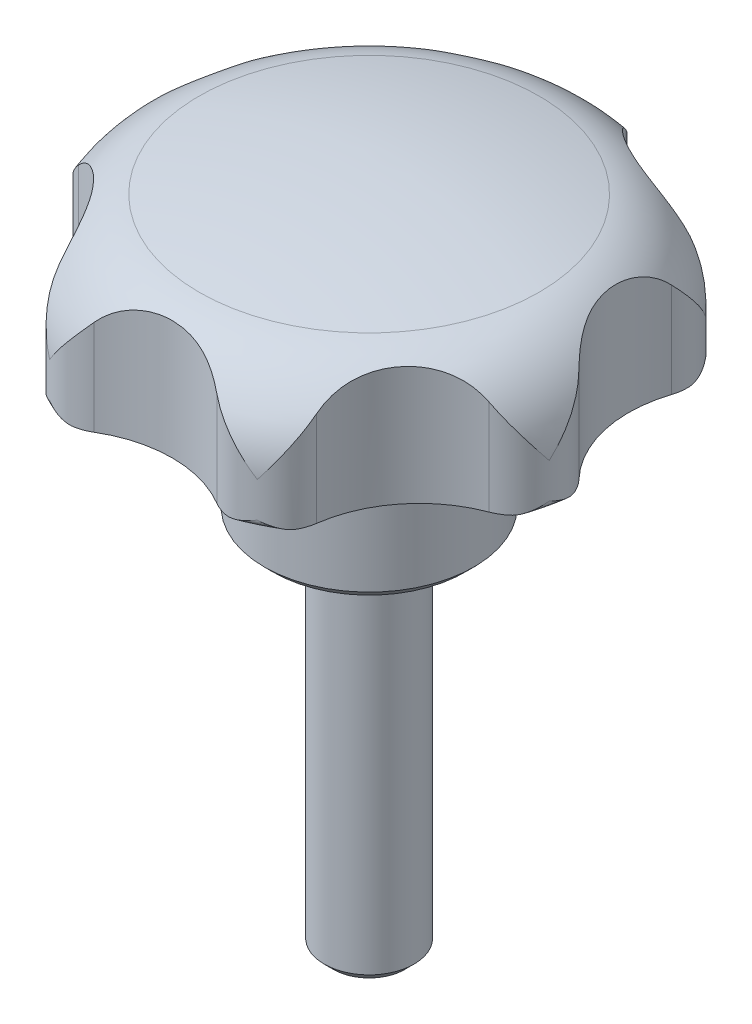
from build123d import *

# Parameters (mm, degrees)
ESQUISSE2_R             = 21
ENL_V_MAT_EXTRU_1_DEPTH = 21
ESQUISSE3_R             = 8
ENL_V_MAT_EXTRU_2_DEPTH = 17


with BuildPart() as part:
    # Esquisse1 → R_volution1 (revolve)
    with BuildSketch(Plane.XY, mode=Mode.PRIVATE) as r_volution1_sk:
        with BuildLine():
            Line((16, 12.848570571), (16, 10.5))
            ThreePointArc((16, 10.5), (15.853553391, 10.146446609), (15.5, 10))
            Line((15.5, 10), (11.7, 10))
            ThreePointArc((11.7, 10), (11.346446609, 10.146446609), (11.2, 10.5))
            Line((11.2, 10.5), (11.2, 16.279152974))
            ThreePointArc((11.2, 16.279152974), (11.091353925, 16.590347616), (10.812631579, 16.766301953))
            ThreePointArc((10.812631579, 16.766301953), (9.703765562, 17.008902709), (8.589473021, 17.225215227))
            ThreePointArc((8.589473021, 17.225215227), (8.179638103, 17.117171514), (8, 16.733285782))
            Line((8, 16.733285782), (8, 11))
            Line((8, 11), (7, 10))
            Line((7, 10), (7, 0.6))
            Line((7, 0.6), (6.4, 0))
            Line((6.4, 0), (0, 0))
            Line((0, 0), (0, 20))
            ThreePointArc((0, 20), (5.719358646, 19.671812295), (11.363636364, 18.691557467))
            ThreePointArc((11.363636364, 18.691557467), (14.700096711, 16.578059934), (16, 12.848570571))
        make_face()
    revolve(r_volution1_sk.sketch.rotate(Axis((0, 0, 0), (0, 1, 0)), 270), axis=Axis((0, 0, 0), (0, 1, 0)))

    # Esquisse2 → Enl_v. mat.-Extru.1 (cut)
    with BuildSketch(Plane(origin=(0, 0, 0), x_dir=(-1, 0, 0), z_dir=(0, 1, 0))):
        Circle(ESQUISSE2_R)
        with BuildLine():
            ThreePointArc((14.842755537, 0.819906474), (15.566010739, 2.094876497), (15.598846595, 3.560334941))
            ThreePointArc((15.598846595, 3.560334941), (14.933423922, 4.866420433), (13.728604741, 5.70132006))
            ThreePointArc((13.728604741, 5.70132006), (10.286064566, 8.202862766), (8.613278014, 12.115736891))
            ThreePointArc((8.613278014, 12.115736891), (8.067408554, 13.476131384), (6.942139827, 14.415501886))
            ThreePointArc((6.942139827, 14.415501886), (5.50611682, 14.709584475), (4.102173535, 14.288170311))
            ThreePointArc((4.102173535, 14.288170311), (1e-09, 13.156370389), (-4.102173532, 14.288170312))
            ThreePointArc((-4.102173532, 14.288170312), (-5.506116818, 14.709584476), (-6.942139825, 14.415501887))
            ThreePointArc((-6.942139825, 14.415501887), (-8.067408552, 13.476131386), (-8.613278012, 12.115736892))
            ThreePointArc((-8.613278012, 12.115736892), (-10.286064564, 8.202862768), (-13.72860474, 5.701320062))
            ThreePointArc((-13.72860474, 5.701320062), (-14.933423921, 4.866420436), (-15.598846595, 3.560334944))
            ThreePointArc((-15.598846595, 3.560334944), (-15.566010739, 2.0948765), (-14.842755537, 0.819906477))
            ThreePointArc((-14.842755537, 0.819906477), (-12.826512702, -2.927567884), (-13.017116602, -7.178740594))
            ThreePointArc((-13.017116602, -7.178740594), (-13.115558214, -8.641257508), (-12.50930372, -9.975836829))
            ThreePointArc((-12.50930372, -9.975836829), (-11.34308935, -10.863863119), (-9.895335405, -11.093330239))
            ThreePointArc((-9.895335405, -11.093330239), (-5.708335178, -11.853480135), (-2.503474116, -14.653063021))
            ThreePointArc((-2.503474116, -14.653063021), (-1.42140554, -15.641894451), (9.395e-06, -16))
            ThreePointArc((9.395e-06, -16), (1.421413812, -15.64189), (2.503474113, -14.653063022))
            ThreePointArc((2.503474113, -14.653063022), (5.708335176, -11.853480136), (9.895335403, -11.09333024))
            ThreePointArc((9.895335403, -11.09333024), (11.343089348, -10.863863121), (12.509303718, -9.975836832))
            ThreePointArc((12.509303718, -9.975836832), (13.115558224, -8.641257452), (13.017116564, -7.178740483))
            ThreePointArc((13.017116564, -7.178740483), (12.826512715, -2.927567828), (14.842755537, 0.819906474))
        make_face(mode=Mode.SUBTRACT)
    extrude(amount=ENL_V_MAT_EXTRU_1_DEPTH, mode=Mode.SUBTRACT)

    # Esquisse3 → Enl_v. mat.-Extru.2 (cut)
    with BuildSketch(Plane(origin=(0, 0, 0), x_dir=(-1, 0, 0), z_dir=(0, 1, 0))):
        with BuildLine():
            ThreePointArc((13.069701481, 0.577260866), (13.648990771, 1.78016747), (13.648990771, 3.115293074))
            ThreePointArc((13.648990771, 3.115293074), (13.069701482, 4.318199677), (12.025858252, 5.150636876))
            ThreePointArc((12.025858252, 5.150636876), (9.242276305, 7.370469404), (7.697504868, 10.578220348))
            ThreePointArc((7.697504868, 10.578220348), (7.118215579, 11.781126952), (6.074372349, 12.61356415))
            ThreePointArc((6.074372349, 12.61356415), (4.772721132, 12.910657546), (3.471069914, 12.61356415))
            ThreePointArc((3.471069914, 12.61356415), (1e-09, 11.821315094), (-3.471069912, 12.613564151))
            ThreePointArc((-3.471069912, 12.613564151), (-4.772721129, 12.910657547), (-6.074372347, 12.613564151))
            ThreePointArc((-6.074372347, 12.613564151), (-7.118215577, 11.781126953), (-7.697504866, 10.578220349))
            ThreePointArc((-7.697504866, 10.578220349), (-9.242276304, 7.370469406), (-12.025858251, 5.150636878))
            ThreePointArc((-12.025858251, 5.150636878), (-13.069701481, 4.31819968), (-13.64899077, 3.115293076))
            ThreePointArc((-13.64899077, 3.115293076), (-13.64899077, 1.780167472), (-13.069701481, 0.577260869))
            ThreePointArc((-13.069701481, 0.577260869), (-11.524930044, -2.630490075), (-11.524930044, -6.190825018))
            ThreePointArc((-11.524930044, -6.190825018), (-11.524930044, -7.525950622), (-10.945640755, -8.728857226))
            ThreePointArc((-10.945640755, -8.728857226), (-9.901797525, -9.561294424), (-8.600146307, -9.85838782))
            ThreePointArc((-8.600146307, -9.85838782), (-5.129076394, -10.650636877), (-2.345494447, -12.870469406))
            ThreePointArc((-2.345494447, -12.870469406), (-1.301648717, -13.702907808), (5.552e-06, -14))
            ThreePointArc((5.552e-06, -14), (1.301653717, -13.7029054), (2.345494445, -12.870469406))
            ThreePointArc((2.345494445, -12.870469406), (5.129076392, -10.650636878), (8.600146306, -9.858387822))
            ThreePointArc((8.600146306, -9.858387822), (9.901797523, -9.561294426), (10.945640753, -8.728857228))
            ThreePointArc((10.945640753, -8.728857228), (11.524930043, -7.525950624), (11.524930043, -6.19082502))
            ThreePointArc((11.524930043, -6.19082502), (11.524930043, -2.630490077), (13.069701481, 0.577260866))
        make_face()
        with Locations(Location((0, 0, 0), (0, 0, 90))):
            Circle(ESQUISSE3_R, mode=Mode.SUBTRACT)
    extrude(amount=ENL_V_MAT_EXTRU_2_DEPTH, mode=Mode.SUBTRACT)

    # Esquisse4 → R_volution2 (revolve)
    with BuildSketch(Plane.XY):
        Polygon((0, 0), (3, 0), (3, -24.3865), (2.3865, -25), (0, -25), align=None)
    revolve(axis=Axis((0, -25, 0), (0, 1, 0)))


solid = part.part
